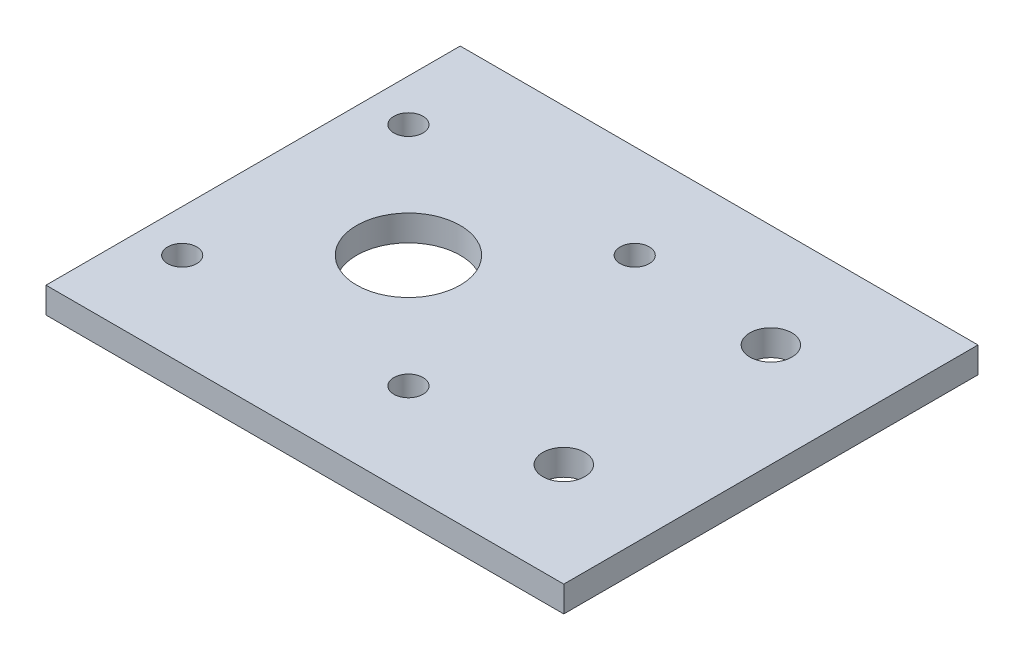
ISO-10303-21;
HEADER;
FILE_DESCRIPTION(('STEP AP214'),'2;1');
FILE_NAME('part.step','',(''),(''),'','','');
FILE_SCHEMA(('AUTOMOTIVE_DESIGN { 1 0 10303 214 1 1 1 1 }'));
ENDSEC;
DATA;
#1=APPLICATION_CONTEXT('core data for automotive mechanical design processes');
#2=APPLICATION_PROTOCOL_DEFINITION('international standard','automotive_design',2000,#1);
#3=PRODUCT_CONTEXT('',#1,'mechanical');
#4=PRODUCT('Part','Part','',(#3));
#5=PRODUCT_RELATED_PRODUCT_CATEGORY('part','',(#4));
#6=PRODUCT_DEFINITION_FORMATION('','',#4);
#7=PRODUCT_DEFINITION_CONTEXT('part definition',#1,'design');
#8=PRODUCT_DEFINITION('design','',#6,#7);
#9=PRODUCT_DEFINITION_SHAPE('','',#8);
#10=(LENGTH_UNIT() NAMED_UNIT(*) SI_UNIT(.MILLI.,.METRE.));
#11=(NAMED_UNIT(*) PLANE_ANGLE_UNIT() SI_UNIT($,.RADIAN.));
#12=(NAMED_UNIT(*) SI_UNIT($,.STERADIAN.) SOLID_ANGLE_UNIT());
#13=UNCERTAINTY_MEASURE_WITH_UNIT(LENGTH_MEASURE(1.E-05),#10,'distance_accuracy_value','');
#14=(GEOMETRIC_REPRESENTATION_CONTEXT(3) GLOBAL_UNCERTAINTY_ASSIGNED_CONTEXT((#13)) GLOBAL_UNIT_ASSIGNED_CONTEXT((#10,
#11,#12)) REPRESENTATION_CONTEXT('',''));
#15=CARTESIAN_POINT('',(0.,0.,0.));
#16=DIRECTION('',(0.,0.,1.));
#17=DIRECTION('',(1.,0.,0.));
#18=AXIS2_PLACEMENT_3D('',#15,#16,#17);
#19=CARTESIAN_POINT('',(0.,12.7,0.));
#20=DIRECTION('',(0.,-1.,0.));
#21=DIRECTION('',(0.,0.,-1.));
#22=AXIS2_PLACEMENT_3D('',#19,#20,#21);
#23=PLANE('',#22);
#24=CARTESIAN_POINT('',(-233.298999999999,12.7,46.101));
#25=DIRECTION('',(0.,-1.,0.));
#26=DIRECTION('',(0.,0.,1.));
#27=AXIS2_PLACEMENT_3D('',#24,#25,#26);
#28=CIRCLE('',#27,7.14375);
#29=CARTESIAN_POINT('',(-233.298999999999,12.7,53.24475));
#30=VERTEX_POINT('',#29);
#31=EDGE_CURVE('E140',#30,#30,#28,.T.);
#32=ORIENTED_EDGE('',*,*,#31,.T.);
#33=EDGE_LOOP('',(#32));
#34=FACE_BOUND('',#33,.T.);
#35=CARTESIAN_POINT('',(-122.301,12.7,157.099));
#36=DIRECTION('',(0.,1.,0.));
#37=DIRECTION('',(0.,0.,1.));
#38=AXIS2_PLACEMENT_3D('',#35,#36,#37);
#39=CIRCLE('',#38,7.14375);
#40=CARTESIAN_POINT('',(-122.301,12.7,164.24275));
#41=VERTEX_POINT('',#40);
#42=EDGE_CURVE('E134',#41,#41,#39,.T.);
#43=ORIENTED_EDGE('',*,*,#42,.F.);
#44=EDGE_LOOP('',(#43));
#45=FACE_BOUND('',#44,.T.);
#46=CARTESIAN_POINT('',(-122.301,12.7,46.101));
#47=DIRECTION('',(0.,1.,0.));
#48=DIRECTION('',(0.,0.,1.));
#49=AXIS2_PLACEMENT_3D('',#46,#47,#48);
#50=CIRCLE('',#49,7.14375);
#51=CARTESIAN_POINT('',(-122.301,12.7,53.24475));
#52=VERTEX_POINT('',#51);
#53=EDGE_CURVE('E128',#52,#52,#50,.T.);
#54=ORIENTED_EDGE('',*,*,#53,.F.);
#55=EDGE_LOOP('',(#54));
#56=FACE_BOUND('',#55,.T.);
#57=CARTESIAN_POINT('',(-177.8,12.7,101.6));
#58=DIRECTION('',(0.,1.,0.));
#59=DIRECTION('',(0.,0.,1.));
#60=AXIS2_PLACEMENT_3D('',#57,#58,#59);
#61=CIRCLE('',#60,25.4);
#62=CARTESIAN_POINT('',(-177.8,12.7,127.));
#63=VERTEX_POINT('',#62);
#64=EDGE_CURVE('E122',#63,#63,#61,.T.);
#65=ORIENTED_EDGE('',*,*,#64,.F.);
#66=EDGE_LOOP('',(#65));
#67=FACE_BOUND('',#66,.T.);
#68=CARTESIAN_POINT('',(-50.8,12.7,152.4));
#69=DIRECTION('',(0.,1.,0.));
#70=DIRECTION('',(0.,0.,1.));
#71=AXIS2_PLACEMENT_3D('',#68,#69,#70);
#72=CIRCLE('',#71,10.31875);
#73=CARTESIAN_POINT('',(-50.8,12.7,162.71875));
#74=VERTEX_POINT('',#73);
#75=EDGE_CURVE('E116',#74,#74,#72,.T.);
#76=ORIENTED_EDGE('',*,*,#75,.F.);
#77=EDGE_LOOP('',(#76));
#78=FACE_BOUND('',#77,.T.);
#79=CARTESIAN_POINT('',(-50.8,12.7,50.8));
#80=DIRECTION('',(0.,1.,0.));
#81=DIRECTION('',(0.,0.,1.));
#82=AXIS2_PLACEMENT_3D('',#79,#80,#81);
#83=CIRCLE('',#82,10.31875);
#84=CARTESIAN_POINT('',(-50.8,12.7,61.11875));
#85=VERTEX_POINT('',#84);
#86=EDGE_CURVE('E110',#85,#85,#83,.T.);
#87=ORIENTED_EDGE('',*,*,#86,.F.);
#88=EDGE_LOOP('',(#87));
#89=FACE_BOUND('',#88,.T.);
#90=DIRECTION('',(0.,0.,-1.));
#91=VECTOR('',#90,1.);
#92=CARTESIAN_POINT('',(0.,12.7,0.));
#93=LINE('',#92,#91);
#94=CARTESIAN_POINT('',(0.,12.7,203.2));
#95=VERTEX_POINT('',#94);
#96=CARTESIAN_POINT('',(0.,12.7,0.));
#97=VERTEX_POINT('',#96);
#98=EDGE_CURVE('E83',#95,#97,#93,.T.);
#99=ORIENTED_EDGE('',*,*,#98,.T.);
#100=DIRECTION('',(-1.,0.,0.));
#101=VECTOR('',#100,1.);
#102=CARTESIAN_POINT('',(0.,12.7,0.));
#103=LINE('',#102,#101);
#104=CARTESIAN_POINT('',(-254.,12.7,0.));
#105=VERTEX_POINT('',#104);
#106=EDGE_CURVE('E78',#97,#105,#103,.T.);
#107=ORIENTED_EDGE('',*,*,#106,.T.);
#108=DIRECTION('',(0.,0.,1.));
#109=VECTOR('',#108,1.);
#110=CARTESIAN_POINT('',(-254.,12.7,0.));
#111=LINE('',#110,#109);
#112=CARTESIAN_POINT('',(-254.,12.7,203.2));
#113=VERTEX_POINT('',#112);
#114=EDGE_CURVE('E81',#105,#113,#111,.T.);
#115=ORIENTED_EDGE('',*,*,#114,.T.);
#116=DIRECTION('',(1.,0.,0.));
#117=VECTOR('',#116,1.);
#118=CARTESIAN_POINT('',(0.,12.7,203.2));
#119=LINE('',#118,#117);
#120=EDGE_CURVE('E48',#113,#95,#119,.T.);
#121=ORIENTED_EDGE('',*,*,#120,.T.);
#122=EDGE_LOOP('',(#99,#107,#115,#121));
#123=FACE_BOUND('',#122,.T.);
#124=CARTESIAN_POINT('',(-233.298999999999,12.7,157.099));
#125=DIRECTION('',(0.,-1.,0.));
#126=DIRECTION('',(0.,0.,1.));
#127=AXIS2_PLACEMENT_3D('',#124,#125,#126);
#128=CIRCLE('',#127,7.14375);
#129=CARTESIAN_POINT('',(-233.298999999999,12.7,164.24275));
#130=VERTEX_POINT('',#129);
#131=EDGE_CURVE('E146',#130,#130,#128,.T.);
#132=ORIENTED_EDGE('',*,*,#131,.T.);
#133=EDGE_LOOP('',(#132));
#134=FACE_BOUND('',#133,.T.);
#135=ADVANCED_FACE('F31',(#34,#45,#56,#67,#78,#89,#123,#134),#23,.F.);
#136=CARTESIAN_POINT('',(0.,0.,0.));
#137=DIRECTION('',(0.,-1.,0.));
#138=DIRECTION('',(0.,0.,-1.));
#139=AXIS2_PLACEMENT_3D('',#136,#137,#138);
#140=PLANE('',#139);
#141=CARTESIAN_POINT('',(-233.298999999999,0.,46.101));
#142=DIRECTION('',(0.,-1.,0.));
#143=DIRECTION('',(0.,0.,1.));
#144=AXIS2_PLACEMENT_3D('',#141,#142,#143);
#145=CIRCLE('',#144,7.14375);
#146=CARTESIAN_POINT('',(-233.298999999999,0.,53.24475));
#147=VERTEX_POINT('',#146);
#148=EDGE_CURVE('E137',#147,#147,#145,.T.);
#149=ORIENTED_EDGE('',*,*,#148,.F.);
#150=EDGE_LOOP('',(#149));
#151=FACE_BOUND('',#150,.T.);
#152=CARTESIAN_POINT('',(-122.301,0.,157.099));
#153=DIRECTION('',(0.,1.,0.));
#154=DIRECTION('',(0.,0.,1.));
#155=AXIS2_PLACEMENT_3D('',#152,#153,#154);
#156=CIRCLE('',#155,7.14375);
#157=CARTESIAN_POINT('',(-122.301,0.,164.24275));
#158=VERTEX_POINT('',#157);
#159=EDGE_CURVE('E131',#158,#158,#156,.T.);
#160=ORIENTED_EDGE('',*,*,#159,.T.);
#161=EDGE_LOOP('',(#160));
#162=FACE_BOUND('',#161,.T.);
#163=CARTESIAN_POINT('',(-122.301,0.,46.101));
#164=DIRECTION('',(0.,1.,0.));
#165=DIRECTION('',(0.,0.,1.));
#166=AXIS2_PLACEMENT_3D('',#163,#164,#165);
#167=CIRCLE('',#166,7.14375);
#168=CARTESIAN_POINT('',(-122.301,0.,53.24475));
#169=VERTEX_POINT('',#168);
#170=EDGE_CURVE('E125',#169,#169,#167,.T.);
#171=ORIENTED_EDGE('',*,*,#170,.T.);
#172=EDGE_LOOP('',(#171));
#173=FACE_BOUND('',#172,.T.);
#174=CARTESIAN_POINT('',(-177.8,0.,101.6));
#175=DIRECTION('',(0.,1.,0.));
#176=DIRECTION('',(0.,0.,1.));
#177=AXIS2_PLACEMENT_3D('',#174,#175,#176);
#178=CIRCLE('',#177,25.4);
#179=CARTESIAN_POINT('',(-177.8,0.,127.));
#180=VERTEX_POINT('',#179);
#181=EDGE_CURVE('E119',#180,#180,#178,.T.);
#182=ORIENTED_EDGE('',*,*,#181,.T.);
#183=EDGE_LOOP('',(#182));
#184=FACE_BOUND('',#183,.T.);
#185=CARTESIAN_POINT('',(-50.8,0.,152.4));
#186=DIRECTION('',(0.,1.,0.));
#187=DIRECTION('',(0.,0.,1.));
#188=AXIS2_PLACEMENT_3D('',#185,#186,#187);
#189=CIRCLE('',#188,10.31875);
#190=CARTESIAN_POINT('',(-50.8,0.,162.71875));
#191=VERTEX_POINT('',#190);
#192=EDGE_CURVE('E113',#191,#191,#189,.T.);
#193=ORIENTED_EDGE('',*,*,#192,.T.);
#194=EDGE_LOOP('',(#193));
#195=FACE_BOUND('',#194,.T.);
#196=CARTESIAN_POINT('',(-50.8,0.,50.8));
#197=DIRECTION('',(0.,1.,0.));
#198=DIRECTION('',(0.,0.,1.));
#199=AXIS2_PLACEMENT_3D('',#196,#197,#198);
#200=CIRCLE('',#199,10.31875);
#201=CARTESIAN_POINT('',(-50.8,0.,61.11875));
#202=VERTEX_POINT('',#201);
#203=EDGE_CURVE('E98',#202,#202,#200,.T.);
#204=ORIENTED_EDGE('',*,*,#203,.T.);
#205=EDGE_LOOP('',(#204));
#206=FACE_BOUND('',#205,.T.);
#207=DIRECTION('',(0.,0.,-1.));
#208=VECTOR('',#207,1.);
#209=CARTESIAN_POINT('',(0.,0.,0.));
#210=LINE('',#209,#208);
#211=CARTESIAN_POINT('',(0.,0.,203.2));
#212=VERTEX_POINT('',#211);
#213=CARTESIAN_POINT('',(0.,0.,0.));
#214=VERTEX_POINT('',#213);
#215=EDGE_CURVE('E95',#212,#214,#210,.T.);
#216=ORIENTED_EDGE('',*,*,#215,.F.);
#217=DIRECTION('',(1.,0.,0.));
#218=VECTOR('',#217,1.);
#219=CARTESIAN_POINT('',(0.,0.,203.2));
#220=LINE('',#219,#218);
#221=CARTESIAN_POINT('',(-254.,0.,203.2));
#222=VERTEX_POINT('',#221);
#223=EDGE_CURVE('E71',#222,#212,#220,.T.);
#224=ORIENTED_EDGE('',*,*,#223,.F.);
#225=DIRECTION('',(0.,0.,1.));
#226=VECTOR('',#225,1.);
#227=CARTESIAN_POINT('',(-254.,0.,0.));
#228=LINE('',#227,#226);
#229=CARTESIAN_POINT('',(-254.,0.,0.));
#230=VERTEX_POINT('',#229);
#231=EDGE_CURVE('E65',#230,#222,#228,.T.);
#232=ORIENTED_EDGE('',*,*,#231,.F.);
#233=DIRECTION('',(-1.,0.,0.));
#234=VECTOR('',#233,1.);
#235=CARTESIAN_POINT('',(0.,0.,0.));
#236=LINE('',#235,#234);
#237=EDGE_CURVE('E87',#214,#230,#236,.T.);
#238=ORIENTED_EDGE('',*,*,#237,.F.);
#239=EDGE_LOOP('',(#216,#224,#232,#238));
#240=FACE_BOUND('',#239,.T.);
#241=CARTESIAN_POINT('',(-233.298999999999,0.,157.099));
#242=DIRECTION('',(0.,-1.,0.));
#243=DIRECTION('',(0.,0.,1.));
#244=AXIS2_PLACEMENT_3D('',#241,#242,#243);
#245=CIRCLE('',#244,7.14375);
#246=CARTESIAN_POINT('',(-233.298999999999,0.,164.24275));
#247=VERTEX_POINT('',#246);
#248=EDGE_CURVE('E143',#247,#247,#245,.T.);
#249=ORIENTED_EDGE('',*,*,#248,.F.);
#250=EDGE_LOOP('',(#249));
#251=FACE_BOUND('',#250,.T.);
#252=ADVANCED_FACE('F106',(#151,#162,#173,#184,#195,#206,#240,#251),#140,.T.);
#253=CARTESIAN_POINT('',(0.,12.7,0.));
#254=DIRECTION('',(-1.,0.,0.));
#255=DIRECTION('',(0.,0.,1.));
#256=AXIS2_PLACEMENT_3D('',#253,#254,#255);
#257=PLANE('',#256);
#258=ORIENTED_EDGE('',*,*,#215,.T.);
#259=DIRECTION('',(0.,-1.,0.));
#260=VECTOR('',#259,1.);
#261=CARTESIAN_POINT('',(0.,12.7,0.));
#262=LINE('',#261,#260);
#263=EDGE_CURVE('E11',#97,#214,#262,.T.);
#264=ORIENTED_EDGE('',*,*,#263,.F.);
#265=ORIENTED_EDGE('',*,*,#98,.F.);
#266=DIRECTION('',(0.,-1.,0.));
#267=VECTOR('',#266,1.);
#268=CARTESIAN_POINT('',(0.,12.7,203.2));
#269=LINE('',#268,#267);
#270=EDGE_CURVE('E91',#95,#212,#269,.T.);
#271=ORIENTED_EDGE('',*,*,#270,.T.);
#272=EDGE_LOOP('',(#258,#264,#265,#271));
#273=FACE_BOUND('',#272,.T.);
#274=ADVANCED_FACE('F33',(#273),#257,.F.);
#275=CARTESIAN_POINT('',(0.,12.7,0.));
#276=DIRECTION('',(0.,0.,1.));
#277=DIRECTION('',(1.,0.,0.));
#278=AXIS2_PLACEMENT_3D('',#275,#276,#277);
#279=PLANE('',#278);
#280=ORIENTED_EDGE('',*,*,#237,.T.);
#281=DIRECTION('',(0.,-1.,0.));
#282=VECTOR('',#281,1.);
#283=CARTESIAN_POINT('',(-254.,12.7,0.));
#284=LINE('',#283,#282);
#285=EDGE_CURVE('E40',#105,#230,#284,.T.);
#286=ORIENTED_EDGE('',*,*,#285,.F.);
#287=ORIENTED_EDGE('',*,*,#106,.F.);
#288=ORIENTED_EDGE('',*,*,#263,.T.);
#289=EDGE_LOOP('',(#280,#286,#287,#288));
#290=FACE_BOUND('',#289,.T.);
#291=ADVANCED_FACE('F86',(#290),#279,.F.);
#292=CARTESIAN_POINT('',(-254.,12.7,0.));
#293=DIRECTION('',(1.,0.,0.));
#294=DIRECTION('',(0.,0.,-1.));
#295=AXIS2_PLACEMENT_3D('',#292,#293,#294);
#296=PLANE('',#295);
#297=ORIENTED_EDGE('',*,*,#231,.T.);
#298=DIRECTION('',(0.,-1.,0.));
#299=VECTOR('',#298,1.);
#300=CARTESIAN_POINT('',(-254.,12.7,203.2));
#301=LINE('',#300,#299);
#302=EDGE_CURVE('E88',#113,#222,#301,.T.);
#303=ORIENTED_EDGE('',*,*,#302,.F.);
#304=ORIENTED_EDGE('',*,*,#114,.F.);
#305=ORIENTED_EDGE('',*,*,#285,.T.);
#306=EDGE_LOOP('',(#297,#303,#304,#305));
#307=FACE_BOUND('',#306,.T.);
#308=ADVANCED_FACE('F89',(#307),#296,.F.);
#309=CARTESIAN_POINT('',(0.,12.7,203.2));
#310=DIRECTION('',(0.,0.,-1.));
#311=DIRECTION('',(-1.,0.,0.));
#312=AXIS2_PLACEMENT_3D('',#309,#310,#311);
#313=PLANE('',#312);
#314=ORIENTED_EDGE('',*,*,#223,.T.);
#315=ORIENTED_EDGE('',*,*,#270,.F.);
#316=ORIENTED_EDGE('',*,*,#120,.F.);
#317=ORIENTED_EDGE('',*,*,#302,.T.);
#318=EDGE_LOOP('',(#314,#315,#316,#317));
#319=FACE_BOUND('',#318,.T.);
#320=ADVANCED_FACE('F103',(#319),#313,.F.);
#321=CARTESIAN_POINT('',(-50.8,0.,50.8));
#322=DIRECTION('',(0.,1.,0.));
#323=DIRECTION('',(0.,0.,1.));
#324=AXIS2_PLACEMENT_3D('',#321,#322,#323);
#325=CYLINDRICAL_SURFACE('',#324,10.31875);
#326=ORIENTED_EDGE('',*,*,#203,.F.);
#327=EDGE_LOOP('',(#326));
#328=FACE_BOUND('',#327,.T.);
#329=ORIENTED_EDGE('',*,*,#86,.T.);
#330=EDGE_LOOP('',(#329));
#331=FACE_BOUND('',#330,.T.);
#332=ADVANCED_FACE('F169',(#328,#331),#325,.F.);
#333=CARTESIAN_POINT('',(-50.8,0.,152.4));
#334=DIRECTION('',(0.,1.,0.));
#335=DIRECTION('',(0.,0.,1.));
#336=AXIS2_PLACEMENT_3D('',#333,#334,#335);
#337=CYLINDRICAL_SURFACE('',#336,10.31875);
#338=ORIENTED_EDGE('',*,*,#192,.F.);
#339=EDGE_LOOP('',(#338));
#340=FACE_BOUND('',#339,.T.);
#341=ORIENTED_EDGE('',*,*,#75,.T.);
#342=EDGE_LOOP('',(#341));
#343=FACE_BOUND('',#342,.T.);
#344=ADVANCED_FACE('F190',(#340,#343),#337,.F.);
#345=CARTESIAN_POINT('',(-177.8,0.,101.6));
#346=DIRECTION('',(0.,1.,0.));
#347=DIRECTION('',(0.,0.,1.));
#348=AXIS2_PLACEMENT_3D('',#345,#346,#347);
#349=CYLINDRICAL_SURFACE('',#348,25.4);
#350=ORIENTED_EDGE('',*,*,#181,.F.);
#351=EDGE_LOOP('',(#350));
#352=FACE_BOUND('',#351,.T.);
#353=ORIENTED_EDGE('',*,*,#64,.T.);
#354=EDGE_LOOP('',(#353));
#355=FACE_BOUND('',#354,.T.);
#356=ADVANCED_FACE('F197',(#352,#355),#349,.F.);
#357=CARTESIAN_POINT('',(-122.301,0.,46.101));
#358=DIRECTION('',(0.,1.,0.));
#359=DIRECTION('',(0.,0.,1.));
#360=AXIS2_PLACEMENT_3D('',#357,#358,#359);
#361=CYLINDRICAL_SURFACE('',#360,7.14375);
#362=ORIENTED_EDGE('',*,*,#170,.F.);
#363=EDGE_LOOP('',(#362));
#364=FACE_BOUND('',#363,.T.);
#365=ORIENTED_EDGE('',*,*,#53,.T.);
#366=EDGE_LOOP('',(#365));
#367=FACE_BOUND('',#366,.T.);
#368=ADVANCED_FACE('F205',(#364,#367),#361,.F.);
#369=CARTESIAN_POINT('',(-122.301,0.,157.099));
#370=DIRECTION('',(0.,1.,0.));
#371=DIRECTION('',(0.,0.,1.));
#372=AXIS2_PLACEMENT_3D('',#369,#370,#371);
#373=CYLINDRICAL_SURFACE('',#372,7.14375);
#374=ORIENTED_EDGE('',*,*,#159,.F.);
#375=EDGE_LOOP('',(#374));
#376=FACE_BOUND('',#375,.T.);
#377=ORIENTED_EDGE('',*,*,#42,.T.);
#378=EDGE_LOOP('',(#377));
#379=FACE_BOUND('',#378,.T.);
#380=ADVANCED_FACE('F213',(#376,#379),#373,.F.);
#381=CARTESIAN_POINT('',(-233.298999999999,0.,46.101));
#382=DIRECTION('',(0.,1.,0.));
#383=DIRECTION('',(0.,0.,1.));
#384=AXIS2_PLACEMENT_3D('',#381,#382,#383);
#385=CYLINDRICAL_SURFACE('',#384,7.14375);
#386=ORIENTED_EDGE('',*,*,#148,.T.);
#387=EDGE_LOOP('',(#386));
#388=FACE_BOUND('',#387,.T.);
#389=ORIENTED_EDGE('',*,*,#31,.F.);
#390=EDGE_LOOP('',(#389));
#391=FACE_BOUND('',#390,.T.);
#392=ADVANCED_FACE('F221',(#388,#391),#385,.F.);
#393=CARTESIAN_POINT('',(-233.298999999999,0.,157.099));
#394=DIRECTION('',(0.,1.,0.));
#395=DIRECTION('',(0.,0.,1.));
#396=AXIS2_PLACEMENT_3D('',#393,#394,#395);
#397=CYLINDRICAL_SURFACE('',#396,7.14375);
#398=ORIENTED_EDGE('',*,*,#248,.T.);
#399=EDGE_LOOP('',(#398));
#400=FACE_BOUND('',#399,.T.);
#401=ORIENTED_EDGE('',*,*,#131,.F.);
#402=EDGE_LOOP('',(#401));
#403=FACE_BOUND('',#402,.T.);
#404=ADVANCED_FACE('F152',(#400,#403),#397,.F.);
#405=CLOSED_SHELL('',(#135,#252,#274,#291,#308,#320,#332,#344,#356,#368,#380,#392,#404));
#406=MANIFOLD_SOLID_BREP('B2',#405);
#407=ADVANCED_BREP_SHAPE_REPRESENTATION('',(#18,#406),#14);
#408=SHAPE_DEFINITION_REPRESENTATION(#9,#407);
ENDSEC;
END-ISO-10303-21;
